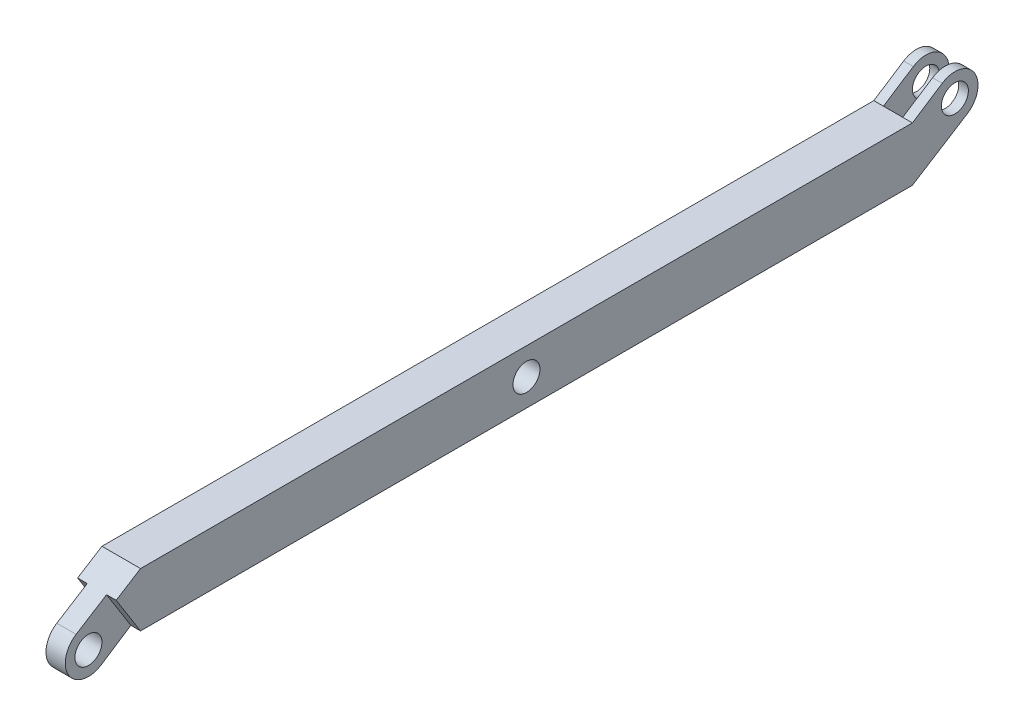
from build123d import *

# Parameters (mm, degrees)
SKETCH1_W           = 100
SKETCH1_H           = 140
SKETCH1_W_2         = 80
SKETCH1_H_2         = 120
BASE_EXTRUDE_DEPTH  = 1000
SKETCH4_R           = 35
BOSS_EXTRUDE1_DEPTH = 25
SKETCH6_R           = 42.5
BOSS_EXTRUDE2_DEPTH = 80
SKETCH5_R           = 35
CUT_EXTRUDE1_DEPTH  = 1182.439799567
SKETCH7_R           = 35
BOSS_EXTRUDE3_DEPTH = 50
CUT_EXTRUDE2_DEPTH  = 25
BOSS_EXTRUDE4_DEPTH = 50


with BuildPart() as part:
    # Sketch1 → Base-Extrude (new, symmetric)
    with BuildSketch(Plane.XY):
        Rectangle(SKETCH1_W, SKETCH1_H)
        Rectangle(SKETCH1_W_2, SKETCH1_H_2, mode=Mode.SUBTRACT)
    extrude(amount=BASE_EXTRUDE_DEPTH, both=True)

    # Sketch4 → Boss-Extrude1 (add, symmetric)
    with BuildSketch(Plane(origin=(0, 0, 0), x_dir=(0, 0, -1), z_dir=(1, 0, 0))):
        with BuildLine():
            Line((-1000, 70), (-1000, -70))
            Line((-1000, -70), (-1077.272727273, -120.288424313))
            ThreePointArc((-1077.272727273, -120.288424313), (-1160.545819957, -102.328317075), (-1141.927337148, -19.199949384))
            Line((-1141.927337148, -19.199949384), (-1000, 70))
        make_face()
        with Locations((-1110, -70)):
            Circle(SKETCH4_R, mode=Mode.SUBTRACT)
    extrude(amount=BOSS_EXTRUDE1_DEPTH, both=True)

    # Sketch6 → Boss-Extrude2 (add)
    with BuildSketch(Plane.ZY.offset(-40)):
        with Locations(Location((0, 0, 0), (0, 0, 180))):
            Circle(SKETCH6_R)
    extrude(amount=BOSS_EXTRUDE2_DEPTH)

    # Sketch5 → Cut-Extrude1 (cut, through all)
    with BuildSketch(Plane(origin=(50, 0, 0), x_dir=(0, 0, -1), z_dir=(1, 0, 0))):
        Circle(SKETCH5_R)
    extrude(amount=-CUT_EXTRUDE1_DEPTH, mode=Mode.SUBTRACT)

    # Sketch7 → Boss-Extrude3 (add, symmetric)
    with BuildSketch(Plane.ZY):
        with BuildLine():
            Line((-960, 70), (-960, -70))
            Line((-960, -70), (-1000, -70))
            Line((-1000, -70), (-1141.927337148, 19.199949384))
            ThreePointArc((-1141.927337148, 19.199949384), (-1160.545819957, 102.328317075), (-1077.272727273, 120.288424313))
            Line((-1077.272727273, 120.288424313), (-1000, 70))
            Line((-1000, 70), (-960, 70))
        make_face()
        with Locations(Location((-1110, 70, 0), (0, 0, 180))):
            Circle(SKETCH7_R, mode=Mode.SUBTRACT)
    extrude(amount=BOSS_EXTRUDE3_DEPTH, both=True)

    # Sketch8 → Cut-Extrude2 (cut, symmetric)
    with BuildSketch(Plane(origin=(0, 0, 0), x_dir=(0, 0, -1), z_dir=(1, 0, 0))):
        Polygon((1000, 70), (1063.074291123, -30.358422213), (1193.537784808, 51.636613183), (1127.561151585, 153.01569704), align=None)
    extrude(amount=CUT_EXTRUDE2_DEPTH, both=True, mode=Mode.SUBTRACT)

    # Sketch10 → Boss-Extrude4 (add, symmetric)
    with BuildSketch(Plane.ZY):
        Polygon((1000, -70), (1063.074291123, 30.358422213), (1000, 70), (950, 70), (950, -70), align=None)
    extrude(amount=BOSS_EXTRUDE4_DEPTH, both=True)


solid = part.part
